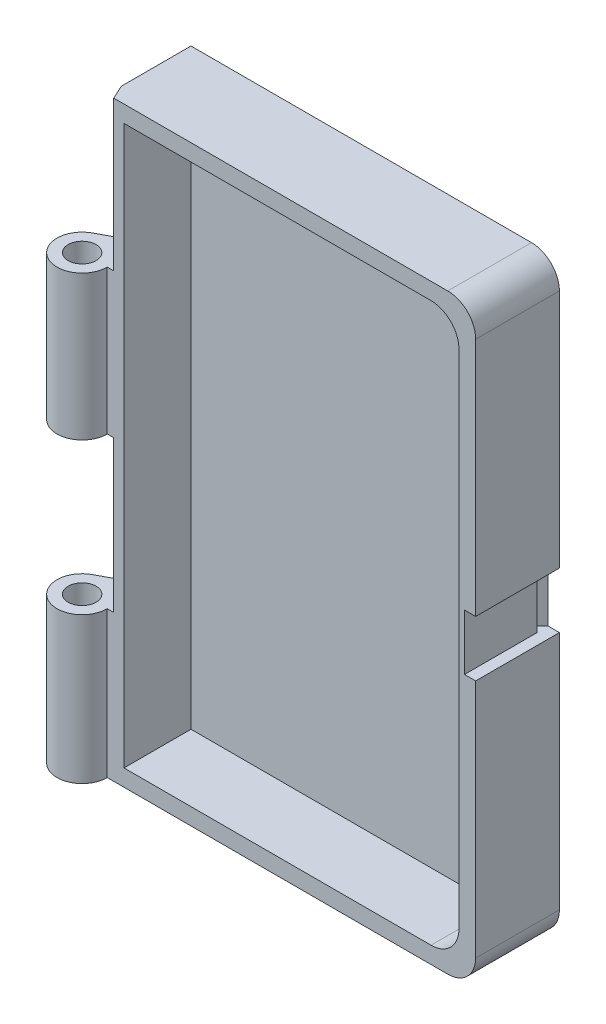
ISO-10303-21;
HEADER;
FILE_DESCRIPTION(('STEP AP214'),'2;1');
FILE_NAME('part.step','',(''),(''),'','','');
FILE_SCHEMA(('AUTOMOTIVE_DESIGN { 1 0 10303 214 1 1 1 1 }'));
ENDSEC;
DATA;
#1=APPLICATION_CONTEXT('core data for automotive mechanical design processes');
#2=APPLICATION_PROTOCOL_DEFINITION('international standard','automotive_design',2000,#1);
#3=PRODUCT_CONTEXT('',#1,'mechanical');
#4=PRODUCT('Part','Part','',(#3));
#5=PRODUCT_RELATED_PRODUCT_CATEGORY('part','',(#4));
#6=PRODUCT_DEFINITION_FORMATION('','',#4);
#7=PRODUCT_DEFINITION_CONTEXT('part definition',#1,'design');
#8=PRODUCT_DEFINITION('design','',#6,#7);
#9=PRODUCT_DEFINITION_SHAPE('','',#8);
#10=(LENGTH_UNIT() NAMED_UNIT(*) SI_UNIT(.MILLI.,.METRE.));
#11=(NAMED_UNIT(*) PLANE_ANGLE_UNIT() SI_UNIT($,.RADIAN.));
#12=(NAMED_UNIT(*) SI_UNIT($,.STERADIAN.) SOLID_ANGLE_UNIT());
#13=UNCERTAINTY_MEASURE_WITH_UNIT(LENGTH_MEASURE(1.E-05),#10,'distance_accuracy_value','');
#14=(GEOMETRIC_REPRESENTATION_CONTEXT(3) GLOBAL_UNCERTAINTY_ASSIGNED_CONTEXT((#13)) GLOBAL_UNIT_ASSIGNED_CONTEXT((#10,
#11,#12)) REPRESENTATION_CONTEXT('',''));
#15=CARTESIAN_POINT('',(0.,0.,0.));
#16=DIRECTION('',(0.,0.,1.));
#17=DIRECTION('',(1.,0.,0.));
#18=AXIS2_PLACEMENT_3D('',#15,#16,#17);
#19=CARTESIAN_POINT('',(33.,-53.,15.));
#20=DIRECTION('',(-1.,0.,0.));
#21=DIRECTION('',(0.,-1.,0.));
#22=AXIS2_PLACEMENT_3D('',#19,#20,#21);
#23=PLANE('',#22);
#24=DIRECTION('',(0.,1.,0.));
#25=VECTOR('',#24,1.);
#26=CARTESIAN_POINT('',(33.,-53.,0.));
#27=LINE('',#26,#25);
#28=CARTESIAN_POINT('',(33.,5.,0.));
#29=VERTEX_POINT('',#28);
#30=CARTESIAN_POINT('',(33.,48.,0.));
#31=VERTEX_POINT('',#30);
#32=EDGE_CURVE('E231',#29,#31,#27,.T.);
#33=ORIENTED_EDGE('',*,*,#32,.T.);
#34=DIRECTION('',(0.,0.,-1.));
#35=VECTOR('',#34,1.);
#36=CARTESIAN_POINT('',(33.,48.,15.));
#37=LINE('',#36,#35);
#38=CARTESIAN_POINT('',(33.,48.,15.));
#39=VERTEX_POINT('',#38);
#40=EDGE_CURVE('E303',#31,#39,#37,.F.);
#41=ORIENTED_EDGE('',*,*,#40,.T.);
#42=DIRECTION('',(0.,1.,0.));
#43=VECTOR('',#42,1.);
#44=CARTESIAN_POINT('',(33.,-53.,15.));
#45=LINE('',#44,#43);
#46=CARTESIAN_POINT('',(33.,5.,15.));
#47=VERTEX_POINT('',#46);
#48=EDGE_CURVE('E234',#47,#39,#45,.T.);
#49=ORIENTED_EDGE('',*,*,#48,.F.);
#50=DIRECTION('',(0.,0.,1.));
#51=VECTOR('',#50,1.);
#52=CARTESIAN_POINT('',(33.,5.,0.));
#53=LINE('',#52,#51);
#54=EDGE_CURVE('E219',#29,#47,#53,.T.);
#55=ORIENTED_EDGE('',*,*,#54,.F.);
#56=EDGE_LOOP('',(#33,#41,#49,#55));
#57=FACE_BOUND('',#56,.T.);
#58=ADVANCED_FACE('F37',(#57),#23,.F.);
#59=CARTESIAN_POINT('',(0.,0.,15.));
#60=DIRECTION('',(0.,0.,1.));
#61=DIRECTION('',(1.,0.,0.));
#62=AXIS2_PLACEMENT_3D('',#59,#60,#61);
#63=PLANE('',#62);
#64=DIRECTION('',(1.,0.,0.));
#65=VECTOR('',#64,1.);
#66=CARTESIAN_POINT('',(-33.,-50.,15.));
#67=LINE('',#66,#65);
#68=CARTESIAN_POINT('',(-30.,-50.,15.));
#69=VERTEX_POINT('',#68);
#70=CARTESIAN_POINT('',(25.,-50.,15.));
#71=VERTEX_POINT('',#70);
#72=EDGE_CURVE('E399',#69,#71,#67,.T.);
#73=ORIENTED_EDGE('',*,*,#72,.F.);
#74=DIRECTION('',(0.,-1.,0.));
#75=VECTOR('',#74,1.);
#76=CARTESIAN_POINT('',(-30.,-53.,15.));
#77=LINE('',#76,#75);
#78=CARTESIAN_POINT('',(-30.,50.,15.));
#79=VERTEX_POINT('',#78);
#80=EDGE_CURVE('E390',#79,#69,#77,.T.);
#81=ORIENTED_EDGE('',*,*,#80,.F.);
#82=DIRECTION('',(-1.,0.,0.));
#83=VECTOR('',#82,1.);
#84=CARTESIAN_POINT('',(-33.,50.,15.));
#85=LINE('',#84,#83);
#86=CARTESIAN_POINT('',(25.,50.,15.));
#87=VERTEX_POINT('',#86);
#88=EDGE_CURVE('E405',#87,#79,#85,.T.);
#89=ORIENTED_EDGE('',*,*,#88,.F.);
#90=CARTESIAN_POINT('',(25.,45.,15.));
#91=DIRECTION('',(0.,0.,1.));
#92=DIRECTION('',(1.,0.,0.));
#93=AXIS2_PLACEMENT_3D('',#90,#91,#92);
#94=CIRCLE('',#93,5.);
#95=CARTESIAN_POINT('',(30.,45.,15.));
#96=VERTEX_POINT('',#95);
#97=EDGE_CURVE('E309',#87,#96,#94,.F.);
#98=ORIENTED_EDGE('',*,*,#97,.T.);
#99=DIRECTION('',(0.,1.,0.));
#100=VECTOR('',#99,1.);
#101=CARTESIAN_POINT('',(30.,-53.,15.));
#102=LINE('',#101,#100);
#103=CARTESIAN_POINT('',(30.,-45.,15.));
#104=VERTEX_POINT('',#103);
#105=EDGE_CURVE('E402',#104,#96,#102,.T.);
#106=ORIENTED_EDGE('',*,*,#105,.F.);
#107=CARTESIAN_POINT('',(25.,-45.,15.));
#108=DIRECTION('',(0.,0.,1.));
#109=DIRECTION('',(1.,0.,0.));
#110=AXIS2_PLACEMENT_3D('',#107,#108,#109);
#111=CIRCLE('',#110,5.);
#112=EDGE_CURVE('E307',#104,#71,#111,.F.);
#113=ORIENTED_EDGE('',*,*,#112,.T.);
#114=EDGE_LOOP('',(#73,#81,#89,#98,#106,#113));
#115=FACE_BOUND('',#114,.T.);
#116=DIRECTION('',(-1.,0.,0.));
#117=VECTOR('',#116,1.);
#118=CARTESIAN_POINT('',(-33.,53.,15.));
#119=LINE('',#118,#117);
#120=CARTESIAN_POINT('',(28.,53.,15.));
#121=VERTEX_POINT('',#120);
#122=CARTESIAN_POINT('',(-31.8342308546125,53.,15.));
#123=VERTEX_POINT('',#122);
#124=EDGE_CURVE('E336',#121,#123,#119,.T.);
#125=ORIENTED_EDGE('',*,*,#124,.T.);
#126=DIRECTION('',(0.,-1.,0.));
#127=VECTOR('',#126,1.);
#128=CARTESIAN_POINT('',(-31.8342308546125,26.2,15.));
#129=LINE('',#128,#127);
#130=CARTESIAN_POINT('',(-31.8342308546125,26.2,15.));
#131=VERTEX_POINT('',#130);
#132=EDGE_CURVE('E328',#123,#131,#129,.T.);
#133=ORIENTED_EDGE('',*,*,#132,.T.);
#134=DIRECTION('',(-1.,0.,0.));
#135=VECTOR('',#134,1.);
#136=CARTESIAN_POINT('',(-33.,26.2,15.));
#137=LINE('',#136,#135);
#138=CARTESIAN_POINT('',(-33.,26.2,15.));
#139=VERTEX_POINT('',#138);
#140=EDGE_CURVE('E326',#131,#139,#137,.T.);
#141=ORIENTED_EDGE('',*,*,#140,.T.);
#142=DIRECTION('',(0.,-1.,0.));
#143=VECTOR('',#142,1.);
#144=CARTESIAN_POINT('',(-33.,-53.,15.));
#145=LINE('',#144,#143);
#146=CARTESIAN_POINT('',(-33.,0.300000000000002,15.));
#147=VERTEX_POINT('',#146);
#148=EDGE_CURVE('E259',#139,#147,#145,.T.);
#149=ORIENTED_EDGE('',*,*,#148,.T.);
#150=DIRECTION('',(1.,0.,0.));
#151=VECTOR('',#150,1.);
#152=CARTESIAN_POINT('',(-33.,0.3,15.));
#153=LINE('',#152,#151);
#154=CARTESIAN_POINT('',(-31.8342308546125,0.3,15.));
#155=VERTEX_POINT('',#154);
#156=EDGE_CURVE('E319',#147,#155,#153,.T.);
#157=ORIENTED_EDGE('',*,*,#156,.T.);
#158=DIRECTION('',(0.,-1.,0.));
#159=VECTOR('',#158,1.);
#160=CARTESIAN_POINT('',(-31.8342308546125,-26.8,15.));
#161=LINE('',#160,#159);
#162=CARTESIAN_POINT('',(-31.8342308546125,-26.8,15.));
#163=VERTEX_POINT('',#162);
#164=EDGE_CURVE('E316',#155,#163,#161,.T.);
#165=ORIENTED_EDGE('',*,*,#164,.T.);
#166=DIRECTION('',(-1.,0.,0.));
#167=VECTOR('',#166,1.);
#168=CARTESIAN_POINT('',(-33.,-26.8,15.));
#169=LINE('',#168,#167);
#170=CARTESIAN_POINT('',(-33.,-26.8,15.));
#171=VERTEX_POINT('',#170);
#172=EDGE_CURVE('E314',#163,#171,#169,.T.);
#173=ORIENTED_EDGE('',*,*,#172,.T.);
#174=CARTESIAN_POINT('',(-33.,-53.,15.));
#175=VERTEX_POINT('',#174);
#176=EDGE_CURVE('E343',#171,#175,#145,.T.);
#177=ORIENTED_EDGE('',*,*,#176,.T.);
#178=DIRECTION('',(1.,0.,0.));
#179=VECTOR('',#178,1.);
#180=CARTESIAN_POINT('',(-33.,-53.,15.));
#181=LINE('',#180,#179);
#182=CARTESIAN_POINT('',(28.,-53.,15.));
#183=VERTEX_POINT('',#182);
#184=EDGE_CURVE('E254',#175,#183,#181,.T.);
#185=ORIENTED_EDGE('',*,*,#184,.T.);
#186=CARTESIAN_POINT('',(28.,-48.,15.));
#187=DIRECTION('',(0.,0.,1.));
#188=DIRECTION('',(1.,0.,0.));
#189=AXIS2_PLACEMENT_3D('',#186,#187,#188);
#190=CIRCLE('',#189,5.);
#191=CARTESIAN_POINT('',(33.,-48.,15.));
#192=VERTEX_POINT('',#191);
#193=EDGE_CURVE('E286',#183,#192,#190,.T.);
#194=ORIENTED_EDGE('',*,*,#193,.T.);
#195=CARTESIAN_POINT('',(33.,-5.,15.));
#196=VERTEX_POINT('',#195);
#197=EDGE_CURVE('E344',#192,#196,#45,.T.);
#198=ORIENTED_EDGE('',*,*,#197,.T.);
#199=DIRECTION('',(-1.,0.,0.));
#200=VECTOR('',#199,1.);
#201=CARTESIAN_POINT('',(33.,-5.,15.));
#202=LINE('',#201,#200);
#203=CARTESIAN_POINT('',(31.,-5.,15.));
#204=VERTEX_POINT('',#203);
#205=EDGE_CURVE('E438',#196,#204,#202,.T.);
#206=ORIENTED_EDGE('',*,*,#205,.T.);
#207=DIRECTION('',(0.,-1.,0.));
#208=VECTOR('',#207,1.);
#209=CARTESIAN_POINT('',(31.,5.,15.));
#210=LINE('',#209,#208);
#211=CARTESIAN_POINT('',(31.,5.,15.));
#212=VERTEX_POINT('',#211);
#213=EDGE_CURVE('E460',#212,#204,#210,.T.);
#214=ORIENTED_EDGE('',*,*,#213,.F.);
#215=DIRECTION('',(-1.,0.,0.));
#216=VECTOR('',#215,1.);
#217=CARTESIAN_POINT('',(33.,5.,15.));
#218=LINE('',#217,#216);
#219=EDGE_CURVE('E235',#47,#212,#218,.T.);
#220=ORIENTED_EDGE('',*,*,#219,.F.);
#221=ORIENTED_EDGE('',*,*,#48,.T.);
#222=CARTESIAN_POINT('',(28.,48.,15.));
#223=DIRECTION('',(0.,0.,1.));
#224=DIRECTION('',(1.,0.,0.));
#225=AXIS2_PLACEMENT_3D('',#222,#223,#224);
#226=CIRCLE('',#225,5.);
#227=EDGE_CURVE('E284',#39,#121,#226,.T.);
#228=ORIENTED_EDGE('',*,*,#227,.T.);
#229=EDGE_LOOP('',(#125,#133,#141,#149,#157,#165,#173,#177,#185,#194,#198,#206,#214,#220,#221,#228));
#230=FACE_BOUND('',#229,.T.);
#231=ADVANCED_FACE('F341',(#115,#230),#63,.T.);
#232=CARTESIAN_POINT('',(0.,0.,0.));
#233=DIRECTION('',(0.,0.,1.));
#234=DIRECTION('',(1.,0.,0.));
#235=AXIS2_PLACEMENT_3D('',#232,#233,#234);
#236=PLANE('',#235);
#237=CARTESIAN_POINT('',(33.,-48.,0.));
#238=VERTEX_POINT('',#237);
#239=CARTESIAN_POINT('',(33.,-5.,0.));
#240=VERTEX_POINT('',#239);
#241=EDGE_CURVE('E241',#238,#240,#27,.T.);
#242=ORIENTED_EDGE('',*,*,#241,.F.);
#243=CARTESIAN_POINT('',(28.,-48.,0.));
#244=DIRECTION('',(0.,0.,1.));
#245=DIRECTION('',(1.,0.,0.));
#246=AXIS2_PLACEMENT_3D('',#243,#244,#245);
#247=CIRCLE('',#246,5.);
#248=CARTESIAN_POINT('',(28.,-53.,0.));
#249=VERTEX_POINT('',#248);
#250=EDGE_CURVE('E280',#238,#249,#247,.F.);
#251=ORIENTED_EDGE('',*,*,#250,.T.);
#252=DIRECTION('',(1.,0.,0.));
#253=VECTOR('',#252,1.);
#254=CARTESIAN_POINT('',(-33.,-53.,0.));
#255=LINE('',#254,#253);
#256=CARTESIAN_POINT('',(-33.,-53.,0.));
#257=VERTEX_POINT('',#256);
#258=EDGE_CURVE('E242',#257,#249,#255,.T.);
#259=ORIENTED_EDGE('',*,*,#258,.F.);
#260=DIRECTION('',(0.,-1.,0.));
#261=VECTOR('',#260,1.);
#262=CARTESIAN_POINT('',(-33.,-53.,0.));
#263=LINE('',#262,#261);
#264=CARTESIAN_POINT('',(-33.,53.,0.));
#265=VERTEX_POINT('',#264);
#266=EDGE_CURVE('E252',#265,#257,#263,.T.);
#267=ORIENTED_EDGE('',*,*,#266,.F.);
#268=DIRECTION('',(-1.,0.,0.));
#269=VECTOR('',#268,1.);
#270=CARTESIAN_POINT('',(-33.,53.,0.));
#271=LINE('',#270,#269);
#272=CARTESIAN_POINT('',(28.,53.,0.));
#273=VERTEX_POINT('',#272);
#274=EDGE_CURVE('E244',#273,#265,#271,.T.);
#275=ORIENTED_EDGE('',*,*,#274,.F.);
#276=CARTESIAN_POINT('',(28.,48.,0.));
#277=DIRECTION('',(0.,0.,1.));
#278=DIRECTION('',(1.,0.,0.));
#279=AXIS2_PLACEMENT_3D('',#276,#277,#278);
#280=CIRCLE('',#279,5.);
#281=EDGE_CURVE('E240',#273,#31,#280,.F.);
#282=ORIENTED_EDGE('',*,*,#281,.T.);
#283=ORIENTED_EDGE('',*,*,#32,.F.);
#284=DIRECTION('',(1.,0.,0.));
#285=VECTOR('',#284,1.);
#286=CARTESIAN_POINT('',(31.,5.,0.));
#287=LINE('',#286,#285);
#288=CARTESIAN_POINT('',(31.,5.,0.));
#289=VERTEX_POINT('',#288);
#290=EDGE_CURVE('E215',#289,#29,#287,.T.);
#291=ORIENTED_EDGE('',*,*,#290,.F.);
#292=DIRECTION('',(0.,-1.,0.));
#293=VECTOR('',#292,1.);
#294=CARTESIAN_POINT('',(31.,5.,0.));
#295=LINE('',#294,#293);
#296=CARTESIAN_POINT('',(31.,-5.,0.));
#297=VERTEX_POINT('',#296);
#298=EDGE_CURVE('E452',#289,#297,#295,.T.);
#299=ORIENTED_EDGE('',*,*,#298,.T.);
#300=DIRECTION('',(1.,0.,0.));
#301=VECTOR('',#300,1.);
#302=CARTESIAN_POINT('',(31.,-5.,0.));
#303=LINE('',#302,#301);
#304=EDGE_CURVE('E439',#297,#240,#303,.T.);
#305=ORIENTED_EDGE('',*,*,#304,.T.);
#306=EDGE_LOOP('',(#242,#251,#259,#267,#275,#282,#283,#291,#299,#305));
#307=FACE_BOUND('',#306,.T.);
#308=ADVANCED_FACE('F238',(#307),#236,.F.);
#309=CARTESIAN_POINT('',(-37.5,53.,15.));
#310=DIRECTION('',(0.,-1.,0.));
#311=DIRECTION('',(0.,0.,-1.));
#312=AXIS2_PLACEMENT_3D('',#309,#310,#311);
#313=CYLINDRICAL_SURFACE('',#312,4.5);
#314=CARTESIAN_POINT('',(-37.5,-26.8,15.));
#315=DIRECTION('',(0.,-1.,0.));
#316=DIRECTION('',(1.,0.,0.));
#317=AXIS2_PLACEMENT_3D('',#314,#315,#316);
#318=CIRCLE('',#317,4.5);
#319=CARTESIAN_POINT('',(-39.6176470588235,-26.8,11.0294117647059));
#320=VERTEX_POINT('',#319);
#321=EDGE_CURVE('E271',#320,#171,#318,.F.);
#322=ORIENTED_EDGE('',*,*,#321,.F.);
#323=DIRECTION('',(0.,-1.,0.));
#324=VECTOR('',#323,1.);
#325=CARTESIAN_POINT('',(-39.6176470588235,53.,11.0294117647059));
#326=LINE('',#325,#324);
#327=CARTESIAN_POINT('',(-39.6176470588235,-53.,11.0294117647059));
#328=VERTEX_POINT('',#327);
#329=EDGE_CURVE('E378',#320,#328,#326,.T.);
#330=ORIENTED_EDGE('',*,*,#329,.T.);
#331=CARTESIAN_POINT('',(-37.5,-53.,15.));
#332=DIRECTION('',(0.,-1.,0.));
#333=DIRECTION('',(0.,0.,1.));
#334=AXIS2_PLACEMENT_3D('',#331,#332,#333);
#335=CIRCLE('',#334,4.5);
#336=EDGE_CURVE('E372',#175,#328,#335,.T.);
#337=ORIENTED_EDGE('',*,*,#336,.F.);
#338=ORIENTED_EDGE('',*,*,#176,.F.);
#339=EDGE_LOOP('',(#322,#330,#337,#338));
#340=FACE_BOUND('',#339,.T.);
#341=ADVANCED_FACE('F416',(#340),#313,.T.);
#342=CARTESIAN_POINT('',(-39.6176470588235,53.,11.0294117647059));
#343=DIRECTION('',(-0.470588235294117,0.,-0.882352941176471));
#344=DIRECTION('',(-0.882352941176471,0.,0.470588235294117));
#345=AXIS2_PLACEMENT_3D('',#342,#343,#344);
#346=PLANE('',#345);
#347=DIRECTION('',(-0.882352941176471,0.,0.470588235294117));
#348=VECTOR('',#347,1.);
#349=CARTESIAN_POINT('',(-39.6176470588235,26.2,11.0294117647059));
#350=LINE('',#349,#348);
#351=CARTESIAN_POINT('',(-33.,26.2,7.5));
#352=VERTEX_POINT('',#351);
#353=CARTESIAN_POINT('',(-39.6176470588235,26.2,11.0294117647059));
#354=VERTEX_POINT('',#353);
#355=EDGE_CURVE('E275',#352,#354,#350,.T.);
#356=ORIENTED_EDGE('',*,*,#355,.F.);
#357=DIRECTION('',(0.,-1.,0.));
#358=VECTOR('',#357,1.);
#359=CARTESIAN_POINT('',(-33.,53.,7.5));
#360=LINE('',#359,#358);
#361=CARTESIAN_POINT('',(-33.,0.300000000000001,7.5));
#362=VERTEX_POINT('',#361);
#363=EDGE_CURVE('E381',#352,#362,#360,.T.);
#364=ORIENTED_EDGE('',*,*,#363,.T.);
#365=DIRECTION('',(0.882352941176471,0.,-0.470588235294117));
#366=VECTOR('',#365,1.);
#367=CARTESIAN_POINT('',(-39.6176470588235,0.300000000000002,11.0294117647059));
#368=LINE('',#367,#366);
#369=CARTESIAN_POINT('',(-39.6176470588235,0.300000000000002,11.0294117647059));
#370=VERTEX_POINT('',#369);
#371=EDGE_CURVE('E270',#370,#362,#368,.T.);
#372=ORIENTED_EDGE('',*,*,#371,.F.);
#373=EDGE_CURVE('E359',#354,#370,#326,.T.);
#374=ORIENTED_EDGE('',*,*,#373,.F.);
#375=EDGE_LOOP('',(#356,#364,#372,#374));
#376=FACE_BOUND('',#375,.T.);
#377=ADVANCED_FACE('F525',(#376),#346,.T.);
#378=CARTESIAN_POINT('',(-33.,-53.,15.));
#379=DIRECTION('',(0.,1.,0.));
#380=DIRECTION('',(0.,0.,1.));
#381=AXIS2_PLACEMENT_3D('',#378,#379,#380);
#382=PLANE('',#381);
#383=ORIENTED_EDGE('',*,*,#258,.T.);
#384=DIRECTION('',(0.,0.,-1.));
#385=VECTOR('',#384,1.);
#386=CARTESIAN_POINT('',(28.,-53.,15.));
#387=LINE('',#386,#385);
#388=EDGE_CURVE('E282',#249,#183,#387,.F.);
#389=ORIENTED_EDGE('',*,*,#388,.T.);
#390=ORIENTED_EDGE('',*,*,#184,.F.);
#391=ORIENTED_EDGE('',*,*,#336,.T.);
#392=DIRECTION('',(0.882352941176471,0.,-0.470588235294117));
#393=VECTOR('',#392,1.);
#394=CARTESIAN_POINT('',(-39.6176470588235,-53.,11.0294117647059));
#395=LINE('',#394,#393);
#396=CARTESIAN_POINT('',(-33.,-53.,7.5));
#397=VERTEX_POINT('',#396);
#398=EDGE_CURVE('E375',#328,#397,#395,.T.);
#399=ORIENTED_EDGE('',*,*,#398,.T.);
#400=DIRECTION('',(0.,0.,-1.));
#401=VECTOR('',#400,1.);
#402=CARTESIAN_POINT('',(-33.,-53.,15.));
#403=LINE('',#402,#401);
#404=EDGE_CURVE('E255',#397,#257,#403,.T.);
#405=ORIENTED_EDGE('',*,*,#404,.T.);
#406=EDGE_LOOP('',(#383,#389,#390,#391,#399,#405));
#407=FACE_BOUND('',#406,.T.);
#408=CARTESIAN_POINT('',(-37.5,-53.,15.));
#409=DIRECTION('',(0.,-1.,0.));
#410=DIRECTION('',(0.,0.,-1.));
#411=AXIS2_PLACEMENT_3D('',#408,#409,#410);
#412=CIRCLE('',#411,2.5);
#413=CARTESIAN_POINT('',(-37.5,-53.,12.5));
#414=VERTEX_POINT('',#413);
#415=EDGE_CURVE('E369',#414,#414,#412,.T.);
#416=ORIENTED_EDGE('',*,*,#415,.F.);
#417=EDGE_LOOP('',(#416));
#418=FACE_BOUND('',#417,.T.);
#419=ADVANCED_FACE('F420',(#407,#418),#382,.F.);
#420=ORIENTED_EDGE('',*,*,#197,.F.);
#421=DIRECTION('',(0.,0.,-1.));
#422=VECTOR('',#421,1.);
#423=CARTESIAN_POINT('',(33.,-48.,15.));
#424=LINE('',#423,#422);
#425=EDGE_CURVE('E261',#192,#238,#424,.T.);
#426=ORIENTED_EDGE('',*,*,#425,.T.);
#427=ORIENTED_EDGE('',*,*,#241,.T.);
#428=DIRECTION('',(0.,0.,1.));
#429=VECTOR('',#428,1.);
#430=CARTESIAN_POINT('',(33.,-5.,0.));
#431=LINE('',#430,#429);
#432=EDGE_CURVE('E434',#240,#196,#431,.T.);
#433=ORIENTED_EDGE('',*,*,#432,.T.);
#434=EDGE_LOOP('',(#420,#426,#427,#433));
#435=FACE_BOUND('',#434,.T.);
#436=ADVANCED_FACE('F432',(#435),#23,.F.);
#437=CARTESIAN_POINT('',(-33.,53.,15.));
#438=DIRECTION('',(0.,-1.,0.));
#439=DIRECTION('',(0.,0.,-1.));
#440=AXIS2_PLACEMENT_3D('',#437,#438,#439);
#441=PLANE('',#440);
#442=DIRECTION('',(0.,0.,-1.));
#443=VECTOR('',#442,1.);
#444=CARTESIAN_POINT('',(-33.,53.,15.));
#445=LINE('',#444,#443);
#446=CARTESIAN_POINT('',(-33.,53.,12.5));
#447=VERTEX_POINT('',#446);
#448=EDGE_CURVE('E258',#447,#265,#445,.T.);
#449=ORIENTED_EDGE('',*,*,#448,.F.);
#450=DIRECTION('',(0.422618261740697,0.,0.906307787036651));
#451=VECTOR('',#450,1.);
#452=CARTESIAN_POINT('',(-31.8342308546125,53.,15.));
#453=LINE('',#452,#451);
#454=EDGE_CURVE('E46',#447,#123,#453,.T.);
#455=ORIENTED_EDGE('',*,*,#454,.T.);
#456=ORIENTED_EDGE('',*,*,#124,.F.);
#457=DIRECTION('',(0.,0.,-1.));
#458=VECTOR('',#457,1.);
#459=CARTESIAN_POINT('',(28.,53.,15.));
#460=LINE('',#459,#458);
#461=EDGE_CURVE('E300',#121,#273,#460,.T.);
#462=ORIENTED_EDGE('',*,*,#461,.T.);
#463=ORIENTED_EDGE('',*,*,#274,.T.);
#464=EDGE_LOOP('',(#449,#455,#456,#462,#463));
#465=FACE_BOUND('',#464,.T.);
#466=ADVANCED_FACE('F335',(#465),#441,.F.);
#467=CARTESIAN_POINT('',(-33.,-53.,15.));
#468=DIRECTION('',(1.,0.,0.));
#469=DIRECTION('',(0.,0.,-1.));
#470=AXIS2_PLACEMENT_3D('',#467,#468,#469);
#471=PLANE('',#470);
#472=DIRECTION('',(0.,0.,-1.));
#473=VECTOR('',#472,1.);
#474=CARTESIAN_POINT('',(-33.,26.2,19.5));
#475=LINE('',#474,#473);
#476=CARTESIAN_POINT('',(-33.,26.2,12.5));
#477=VERTEX_POINT('',#476);
#478=EDGE_CURVE('E266',#477,#352,#475,.T.);
#479=ORIENTED_EDGE('',*,*,#478,.F.);
#480=DIRECTION('',(0.,1.,0.));
#481=VECTOR('',#480,1.);
#482=CARTESIAN_POINT('',(-33.,53.,12.5));
#483=LINE('',#482,#481);
#484=EDGE_CURVE('E53',#477,#447,#483,.T.);
#485=ORIENTED_EDGE('',*,*,#484,.T.);
#486=ORIENTED_EDGE('',*,*,#448,.T.);
#487=ORIENTED_EDGE('',*,*,#266,.T.);
#488=ORIENTED_EDGE('',*,*,#404,.F.);
#489=CARTESIAN_POINT('',(-33.,-26.8,7.5));
#490=VERTEX_POINT('',#489);
#491=EDGE_CURVE('E379',#490,#397,#360,.T.);
#492=ORIENTED_EDGE('',*,*,#491,.F.);
#493=DIRECTION('',(0.,0.,-1.));
#494=VECTOR('',#493,1.);
#495=CARTESIAN_POINT('',(-33.,-26.8,19.5));
#496=LINE('',#495,#494);
#497=CARTESIAN_POINT('',(-33.,-26.8,12.5));
#498=VERTEX_POINT('',#497);
#499=EDGE_CURVE('E454',#498,#490,#496,.T.);
#500=ORIENTED_EDGE('',*,*,#499,.F.);
#501=DIRECTION('',(0.,1.,0.));
#502=VECTOR('',#501,1.);
#503=CARTESIAN_POINT('',(-33.,0.300000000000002,12.5));
#504=LINE('',#503,#502);
#505=CARTESIAN_POINT('',(-33.,0.3,12.5));
#506=VERTEX_POINT('',#505);
#507=EDGE_CURVE('E311',#498,#506,#504,.T.);
#508=ORIENTED_EDGE('',*,*,#507,.T.);
#509=DIRECTION('',(0.,0.,-1.));
#510=VECTOR('',#509,1.);
#511=CARTESIAN_POINT('',(-33.,0.3,19.5));
#512=LINE('',#511,#510);
#513=EDGE_CURVE('E463',#506,#362,#512,.T.);
#514=ORIENTED_EDGE('',*,*,#513,.T.);
#515=ORIENTED_EDGE('',*,*,#363,.F.);
#516=EDGE_LOOP('',(#479,#485,#486,#487,#488,#492,#500,#508,#514,#515));
#517=FACE_BOUND('',#516,.T.);
#518=ADVANCED_FACE('F476',(#517),#471,.F.);
#519=CARTESIAN_POINT('',(-33.,-50.,15.));
#520=DIRECTION('',(0.,1.,0.));
#521=DIRECTION('',(0.,0.,1.));
#522=AXIS2_PLACEMENT_3D('',#519,#520,#521);
#523=PLANE('',#522);
#524=ORIENTED_EDGE('',*,*,#72,.T.);
#525=DIRECTION('',(0.,0.,-1.));
#526=VECTOR('',#525,1.);
#527=CARTESIAN_POINT('',(25.,-50.,3.));
#528=LINE('',#527,#526);
#529=CARTESIAN_POINT('',(25.,-50.,3.));
#530=VERTEX_POINT('',#529);
#531=EDGE_CURVE('E288',#71,#530,#528,.T.);
#532=ORIENTED_EDGE('',*,*,#531,.T.);
#533=DIRECTION('',(1.,0.,0.));
#534=VECTOR('',#533,1.);
#535=CARTESIAN_POINT('',(-33.,-50.,3.));
#536=LINE('',#535,#534);
#537=CARTESIAN_POINT('',(-30.,-50.,3.));
#538=VERTEX_POINT('',#537);
#539=EDGE_CURVE('E383',#538,#530,#536,.T.);
#540=ORIENTED_EDGE('',*,*,#539,.F.);
#541=DIRECTION('',(0.,0.,-1.));
#542=VECTOR('',#541,1.);
#543=CARTESIAN_POINT('',(-30.,-50.,15.));
#544=LINE('',#543,#542);
#545=EDGE_CURVE('E387',#69,#538,#544,.T.);
#546=ORIENTED_EDGE('',*,*,#545,.F.);
#547=EDGE_LOOP('',(#524,#532,#540,#546));
#548=FACE_BOUND('',#547,.T.);
#549=ADVANCED_FACE('F564',(#548),#523,.T.);
#550=CARTESIAN_POINT('',(30.,-53.,15.));
#551=DIRECTION('',(-1.,0.,0.));
#552=DIRECTION('',(0.,-1.,0.));
#553=AXIS2_PLACEMENT_3D('',#550,#551,#552);
#554=PLANE('',#553);
#555=DIRECTION('',(0.,1.,0.));
#556=VECTOR('',#555,1.);
#557=CARTESIAN_POINT('',(30.,-53.,3.));
#558=LINE('',#557,#556);
#559=CARTESIAN_POINT('',(30.,-45.,3.));
#560=VERTEX_POINT('',#559);
#561=CARTESIAN_POINT('',(30.,45.,3.));
#562=VERTEX_POINT('',#561);
#563=EDGE_CURVE('E386',#560,#562,#558,.T.);
#564=ORIENTED_EDGE('',*,*,#563,.F.);
#565=DIRECTION('',(0.,0.,-1.));
#566=VECTOR('',#565,1.);
#567=CARTESIAN_POINT('',(30.,-45.,15.));
#568=LINE('',#567,#566);
#569=EDGE_CURVE('E298',#560,#104,#568,.F.);
#570=ORIENTED_EDGE('',*,*,#569,.T.);
#571=ORIENTED_EDGE('',*,*,#105,.T.);
#572=DIRECTION('',(0.,0.,-1.));
#573=VECTOR('',#572,1.);
#574=CARTESIAN_POINT('',(30.,45.,3.));
#575=LINE('',#574,#573);
#576=EDGE_CURVE('E295',#96,#562,#575,.T.);
#577=ORIENTED_EDGE('',*,*,#576,.T.);
#578=EDGE_LOOP('',(#564,#570,#571,#577));
#579=FACE_BOUND('',#578,.T.);
#580=ADVANCED_FACE('F567',(#579),#554,.T.);
#581=CARTESIAN_POINT('',(-33.,50.,15.));
#582=DIRECTION('',(0.,-1.,0.));
#583=DIRECTION('',(0.,0.,-1.));
#584=AXIS2_PLACEMENT_3D('',#581,#582,#583);
#585=PLANE('',#584);
#586=DIRECTION('',(-1.,0.,0.));
#587=VECTOR('',#586,1.);
#588=CARTESIAN_POINT('',(-33.,50.,3.));
#589=LINE('',#588,#587);
#590=CARTESIAN_POINT('',(25.,50.,3.));
#591=VERTEX_POINT('',#590);
#592=CARTESIAN_POINT('',(-30.,50.,3.));
#593=VERTEX_POINT('',#592);
#594=EDGE_CURVE('E393',#591,#593,#589,.T.);
#595=ORIENTED_EDGE('',*,*,#594,.F.);
#596=DIRECTION('',(0.,0.,-1.));
#597=VECTOR('',#596,1.);
#598=CARTESIAN_POINT('',(25.,50.,15.));
#599=LINE('',#598,#597);
#600=EDGE_CURVE('E305',#591,#87,#599,.F.);
#601=ORIENTED_EDGE('',*,*,#600,.T.);
#602=ORIENTED_EDGE('',*,*,#88,.T.);
#603=DIRECTION('',(0.,0.,-1.));
#604=VECTOR('',#603,1.);
#605=CARTESIAN_POINT('',(-30.,50.,15.));
#606=LINE('',#605,#604);
#607=EDGE_CURVE('E246',#79,#593,#606,.T.);
#608=ORIENTED_EDGE('',*,*,#607,.T.);
#609=EDGE_LOOP('',(#595,#601,#602,#608));
#610=FACE_BOUND('',#609,.T.);
#611=ADVANCED_FACE('F571',(#610),#585,.T.);
#612=CARTESIAN_POINT('',(-30.,-53.,15.));
#613=DIRECTION('',(1.,0.,0.));
#614=DIRECTION('',(0.,0.,-1.));
#615=AXIS2_PLACEMENT_3D('',#612,#613,#614);
#616=PLANE('',#615);
#617=DIRECTION('',(0.,-1.,0.));
#618=VECTOR('',#617,1.);
#619=CARTESIAN_POINT('',(-30.,-53.,3.));
#620=LINE('',#619,#618);
#621=EDGE_CURVE('E395',#593,#538,#620,.T.);
#622=ORIENTED_EDGE('',*,*,#621,.F.);
#623=ORIENTED_EDGE('',*,*,#607,.F.);
#624=ORIENTED_EDGE('',*,*,#80,.T.);
#625=ORIENTED_EDGE('',*,*,#545,.T.);
#626=EDGE_LOOP('',(#622,#623,#624,#625));
#627=FACE_BOUND('',#626,.T.);
#628=ADVANCED_FACE('F575',(#627),#616,.T.);
#629=CARTESIAN_POINT('',(0.,0.,3.));
#630=DIRECTION('',(0.,0.,1.));
#631=DIRECTION('',(1.,0.,0.));
#632=AXIS2_PLACEMENT_3D('',#629,#630,#631);
#633=PLANE('',#632);
#634=ORIENTED_EDGE('',*,*,#539,.T.);
#635=CARTESIAN_POINT('',(25.,-45.,3.));
#636=DIRECTION('',(0.,0.,1.));
#637=DIRECTION('',(1.,0.,0.));
#638=AXIS2_PLACEMENT_3D('',#635,#636,#637);
#639=CIRCLE('',#638,5.);
#640=EDGE_CURVE('E293',#530,#560,#639,.T.);
#641=ORIENTED_EDGE('',*,*,#640,.T.);
#642=ORIENTED_EDGE('',*,*,#563,.T.);
#643=CARTESIAN_POINT('',(25.,45.,3.));
#644=DIRECTION('',(0.,0.,1.));
#645=DIRECTION('',(1.,0.,0.));
#646=AXIS2_PLACEMENT_3D('',#643,#644,#645);
#647=CIRCLE('',#646,5.);
#648=EDGE_CURVE('E291',#562,#591,#647,.T.);
#649=ORIENTED_EDGE('',*,*,#648,.T.);
#650=ORIENTED_EDGE('',*,*,#594,.T.);
#651=ORIENTED_EDGE('',*,*,#621,.T.);
#652=EDGE_LOOP('',(#634,#641,#642,#649,#650,#651));
#653=FACE_BOUND('',#652,.T.);
#654=ADVANCED_FACE('F563',(#653),#633,.T.);
#655=CARTESIAN_POINT('',(-37.5,26.2,15.));
#656=DIRECTION('',(0.,-1.,0.));
#657=DIRECTION('',(0.,0.,-1.));
#658=AXIS2_PLACEMENT_3D('',#655,#656,#657);
#659=CIRCLE('',#658,4.5);
#660=EDGE_CURVE('E350',#354,#139,#659,.F.);
#661=ORIENTED_EDGE('',*,*,#660,.F.);
#662=ORIENTED_EDGE('',*,*,#373,.T.);
#663=CARTESIAN_POINT('',(-37.5,0.300000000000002,15.));
#664=DIRECTION('',(0.,1.,0.));
#665=DIRECTION('',(-1.,0.,0.));
#666=AXIS2_PLACEMENT_3D('',#663,#664,#665);
#667=CIRCLE('',#666,4.5);
#668=EDGE_CURVE('E276',#147,#370,#667,.F.);
#669=ORIENTED_EDGE('',*,*,#668,.F.);
#670=ORIENTED_EDGE('',*,*,#148,.F.);
#671=EDGE_LOOP('',(#661,#662,#669,#670));
#672=FACE_BOUND('',#671,.T.);
#673=ADVANCED_FACE('F357',(#672),#313,.T.);
#674=DIRECTION('',(-0.882352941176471,0.,0.470588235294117));
#675=VECTOR('',#674,1.);
#676=CARTESIAN_POINT('',(-39.6176470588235,-26.8,11.0294117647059));
#677=LINE('',#676,#675);
#678=EDGE_CURVE('E265',#490,#320,#677,.T.);
#679=ORIENTED_EDGE('',*,*,#678,.F.);
#680=ORIENTED_EDGE('',*,*,#491,.T.);
#681=ORIENTED_EDGE('',*,*,#398,.F.);
#682=ORIENTED_EDGE('',*,*,#329,.F.);
#683=EDGE_LOOP('',(#679,#680,#681,#682));
#684=FACE_BOUND('',#683,.T.);
#685=ADVANCED_FACE('F474',(#684),#346,.T.);
#686=CARTESIAN_POINT('',(-37.5,53.,15.));
#687=DIRECTION('',(0.,-1.,0.));
#688=DIRECTION('',(0.,0.,-1.));
#689=AXIS2_PLACEMENT_3D('',#686,#687,#688);
#690=CYLINDRICAL_SURFACE('',#689,2.5);
#691=CARTESIAN_POINT('',(-37.5,-26.8,15.));
#692=DIRECTION('',(0.,-1.,0.));
#693=DIRECTION('',(1.,0.,0.));
#694=AXIS2_PLACEMENT_3D('',#691,#692,#693);
#695=CIRCLE('',#694,2.5);
#696=CARTESIAN_POINT('',(-35.,-26.8,15.));
#697=VERTEX_POINT('',#696);
#698=EDGE_CURVE('E262',#697,#697,#695,.F.);
#699=ORIENTED_EDGE('',*,*,#698,.T.);
#700=EDGE_LOOP('',(#699));
#701=FACE_BOUND('',#700,.T.);
#702=ORIENTED_EDGE('',*,*,#415,.T.);
#703=EDGE_LOOP('',(#702));
#704=FACE_BOUND('',#703,.T.);
#705=ADVANCED_FACE('F554',(#701,#704),#690,.F.);
#706=CARTESIAN_POINT('',(-33.,0.3,19.5));
#707=DIRECTION('',(0.,1.,0.));
#708=DIRECTION('',(-1.,0.,0.));
#709=AXIS2_PLACEMENT_3D('',#706,#707,#708);
#710=PLANE('',#709);
#711=ORIENTED_EDGE('',*,*,#668,.T.);
#712=ORIENTED_EDGE('',*,*,#371,.T.);
#713=ORIENTED_EDGE('',*,*,#513,.F.);
#714=DIRECTION('',(0.422618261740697,0.,0.906307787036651));
#715=VECTOR('',#714,1.);
#716=CARTESIAN_POINT('',(-30.3188444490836,0.3,18.2497566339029));
#717=LINE('',#716,#715);
#718=EDGE_CURVE('E322',#506,#155,#717,.T.);
#719=ORIENTED_EDGE('',*,*,#718,.T.);
#720=ORIENTED_EDGE('',*,*,#156,.F.);
#721=EDGE_LOOP('',(#711,#712,#713,#719,#720));
#722=FACE_BOUND('',#721,.T.);
#723=CARTESIAN_POINT('',(-37.5,0.300000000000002,15.));
#724=DIRECTION('',(0.,1.,0.));
#725=DIRECTION('',(-1.,0.,0.));
#726=AXIS2_PLACEMENT_3D('',#723,#724,#725);
#727=CIRCLE('',#726,2.5);
#728=CARTESIAN_POINT('',(-40.,0.300000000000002,15.));
#729=VERTEX_POINT('',#728);
#730=EDGE_CURVE('E267',#729,#729,#727,.F.);
#731=ORIENTED_EDGE('',*,*,#730,.F.);
#732=EDGE_LOOP('',(#731));
#733=FACE_BOUND('',#732,.T.);
#734=ADVANCED_FACE('F551',(#722,#733),#710,.F.);
#735=CARTESIAN_POINT('',(-33.,-26.8,19.5));
#736=DIRECTION('',(0.,-1.,0.));
#737=DIRECTION('',(1.,0.,0.));
#738=AXIS2_PLACEMENT_3D('',#735,#736,#737);
#739=PLANE('',#738);
#740=ORIENTED_EDGE('',*,*,#321,.T.);
#741=ORIENTED_EDGE('',*,*,#172,.F.);
#742=DIRECTION('',(-0.422618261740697,0.,-0.906307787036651));
#743=VECTOR('',#742,1.);
#744=CARTESIAN_POINT('',(-30.3188444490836,-26.8,18.2497566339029));
#745=LINE('',#744,#743);
#746=EDGE_CURVE('E324',#163,#498,#745,.T.);
#747=ORIENTED_EDGE('',*,*,#746,.T.);
#748=ORIENTED_EDGE('',*,*,#499,.T.);
#749=ORIENTED_EDGE('',*,*,#678,.T.);
#750=EDGE_LOOP('',(#740,#741,#747,#748,#749));
#751=FACE_BOUND('',#750,.T.);
#752=ORIENTED_EDGE('',*,*,#698,.F.);
#753=EDGE_LOOP('',(#752));
#754=FACE_BOUND('',#753,.T.);
#755=ADVANCED_FACE('F468',(#751,#754),#739,.F.);
#756=CARTESIAN_POINT('',(-37.5,26.2,15.));
#757=DIRECTION('',(0.,-1.,0.));
#758=DIRECTION('',(0.,0.,-1.));
#759=AXIS2_PLACEMENT_3D('',#756,#757,#758);
#760=CIRCLE('',#759,2.5);
#761=CARTESIAN_POINT('',(-37.5,26.2,12.5));
#762=VERTEX_POINT('',#761);
#763=EDGE_CURVE('E272',#762,#762,#760,.F.);
#764=ORIENTED_EDGE('',*,*,#763,.T.);
#765=EDGE_LOOP('',(#764));
#766=FACE_BOUND('',#765,.T.);
#767=ORIENTED_EDGE('',*,*,#730,.T.);
#768=EDGE_LOOP('',(#767));
#769=FACE_BOUND('',#768,.T.);
#770=ADVANCED_FACE('F550',(#766,#769),#690,.F.);
#771=CARTESIAN_POINT('',(-33.,26.2,19.5));
#772=DIRECTION('',(0.,-1.,0.));
#773=DIRECTION('',(0.,0.,-1.));
#774=AXIS2_PLACEMENT_3D('',#771,#772,#773);
#775=PLANE('',#774);
#776=ORIENTED_EDGE('',*,*,#660,.T.);
#777=ORIENTED_EDGE('',*,*,#140,.F.);
#778=DIRECTION('',(-0.422618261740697,0.,-0.906307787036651));
#779=VECTOR('',#778,1.);
#780=CARTESIAN_POINT('',(-30.3188444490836,26.2,18.2497566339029));
#781=LINE('',#780,#779);
#782=EDGE_CURVE('E11',#131,#477,#781,.T.);
#783=ORIENTED_EDGE('',*,*,#782,.T.);
#784=ORIENTED_EDGE('',*,*,#478,.T.);
#785=ORIENTED_EDGE('',*,*,#355,.T.);
#786=EDGE_LOOP('',(#776,#777,#783,#784,#785));
#787=FACE_BOUND('',#786,.T.);
#788=ORIENTED_EDGE('',*,*,#763,.F.);
#789=EDGE_LOOP('',(#788));
#790=FACE_BOUND('',#789,.T.);
#791=ADVANCED_FACE('F347',(#787,#790),#775,.F.);
#792=CARTESIAN_POINT('',(31.,5.,0.));
#793=DIRECTION('',(0.707106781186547,0.,0.707106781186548));
#794=DIRECTION('',(0.707106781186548,0.,-0.707106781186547));
#795=AXIS2_PLACEMENT_3D('',#792,#793,#794);
#796=PLANE('',#795);
#797=DIRECTION('',(-0.707106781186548,0.,0.707106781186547));
#798=VECTOR('',#797,1.);
#799=CARTESIAN_POINT('',(31.,-5.,0.));
#800=LINE('',#799,#798);
#801=CARTESIAN_POINT('',(29.,-5.,2.));
#802=VERTEX_POINT('',#801);
#803=EDGE_CURVE('E226',#297,#802,#800,.T.);
#804=ORIENTED_EDGE('',*,*,#803,.F.);
#805=ORIENTED_EDGE('',*,*,#298,.F.);
#806=DIRECTION('',(-0.707106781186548,0.,0.707106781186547));
#807=VECTOR('',#806,1.);
#808=CARTESIAN_POINT('',(31.,5.,0.));
#809=LINE('',#808,#807);
#810=CARTESIAN_POINT('',(29.,5.,2.));
#811=VERTEX_POINT('',#810);
#812=EDGE_CURVE('E222',#289,#811,#809,.T.);
#813=ORIENTED_EDGE('',*,*,#812,.T.);
#814=DIRECTION('',(0.,-1.,0.));
#815=VECTOR('',#814,1.);
#816=CARTESIAN_POINT('',(29.,5.,2.));
#817=LINE('',#816,#815);
#818=EDGE_CURVE('E455',#811,#802,#817,.T.);
#819=ORIENTED_EDGE('',*,*,#818,.T.);
#820=EDGE_LOOP('',(#804,#805,#813,#819));
#821=FACE_BOUND('',#820,.T.);
#822=ADVANCED_FACE('F483',(#821),#796,.T.);
#823=CARTESIAN_POINT('',(29.,5.,2.));
#824=DIRECTION('',(0.,0.,-1.));
#825=DIRECTION('',(-1.,0.,0.));
#826=AXIS2_PLACEMENT_3D('',#823,#824,#825);
#827=PLANE('',#826);
#828=DIRECTION('',(1.,0.,0.));
#829=VECTOR('',#828,1.);
#830=CARTESIAN_POINT('',(29.,-5.,2.));
#831=LINE('',#830,#829);
#832=CARTESIAN_POINT('',(31.,-5.,2.));
#833=VERTEX_POINT('',#832);
#834=EDGE_CURVE('E448',#802,#833,#831,.T.);
#835=ORIENTED_EDGE('',*,*,#834,.F.);
#836=ORIENTED_EDGE('',*,*,#818,.F.);
#837=DIRECTION('',(1.,0.,0.));
#838=VECTOR('',#837,1.);
#839=CARTESIAN_POINT('',(29.,5.,2.));
#840=LINE('',#839,#838);
#841=CARTESIAN_POINT('',(31.,5.,2.));
#842=VERTEX_POINT('',#841);
#843=EDGE_CURVE('E487',#811,#842,#840,.T.);
#844=ORIENTED_EDGE('',*,*,#843,.T.);
#845=DIRECTION('',(0.,-1.,0.));
#846=VECTOR('',#845,1.);
#847=CARTESIAN_POINT('',(31.,5.,2.));
#848=LINE('',#847,#846);
#849=EDGE_CURVE('E458',#842,#833,#848,.T.);
#850=ORIENTED_EDGE('',*,*,#849,.T.);
#851=EDGE_LOOP('',(#835,#836,#844,#850));
#852=FACE_BOUND('',#851,.T.);
#853=ADVANCED_FACE('F485',(#852),#827,.T.);
#854=CARTESIAN_POINT('',(31.,5.,15.));
#855=DIRECTION('',(-1.,0.,0.));
#856=DIRECTION('',(0.,0.,1.));
#857=AXIS2_PLACEMENT_3D('',#854,#855,#856);
#858=PLANE('',#857);
#859=DIRECTION('',(0.,0.,-1.));
#860=VECTOR('',#859,1.);
#861=CARTESIAN_POINT('',(31.,-5.,15.));
#862=LINE('',#861,#860);
#863=EDGE_CURVE('E441',#204,#833,#862,.T.);
#864=ORIENTED_EDGE('',*,*,#863,.T.);
#865=ORIENTED_EDGE('',*,*,#849,.F.);
#866=DIRECTION('',(0.,0.,-1.));
#867=VECTOR('',#866,1.);
#868=CARTESIAN_POINT('',(31.,5.,15.));
#869=LINE('',#868,#867);
#870=EDGE_CURVE('E491',#212,#842,#869,.T.);
#871=ORIENTED_EDGE('',*,*,#870,.F.);
#872=ORIENTED_EDGE('',*,*,#213,.T.);
#873=EDGE_LOOP('',(#864,#865,#871,#872));
#874=FACE_BOUND('',#873,.T.);
#875=ADVANCED_FACE('F490',(#874),#858,.F.);
#876=CARTESIAN_POINT('',(0.,5.,0.));
#877=DIRECTION('',(0.,-1.,0.));
#878=DIRECTION('',(0.,0.,-1.));
#879=AXIS2_PLACEMENT_3D('',#876,#877,#878);
#880=PLANE('',#879);
#881=ORIENTED_EDGE('',*,*,#290,.T.);
#882=ORIENTED_EDGE('',*,*,#54,.T.);
#883=ORIENTED_EDGE('',*,*,#219,.T.);
#884=ORIENTED_EDGE('',*,*,#870,.T.);
#885=ORIENTED_EDGE('',*,*,#843,.F.);
#886=ORIENTED_EDGE('',*,*,#812,.F.);
#887=EDGE_LOOP('',(#881,#882,#883,#884,#885,#886));
#888=FACE_BOUND('',#887,.T.);
#889=ADVANCED_FACE('F217',(#888),#880,.T.);
#890=CARTESIAN_POINT('',(0.,-5.,0.));
#891=DIRECTION('',(0.,-1.,0.));
#892=DIRECTION('',(0.,0.,-1.));
#893=AXIS2_PLACEMENT_3D('',#890,#891,#892);
#894=PLANE('',#893);
#895=ORIENTED_EDGE('',*,*,#304,.F.);
#896=ORIENTED_EDGE('',*,*,#803,.T.);
#897=ORIENTED_EDGE('',*,*,#834,.T.);
#898=ORIENTED_EDGE('',*,*,#863,.F.);
#899=ORIENTED_EDGE('',*,*,#205,.F.);
#900=ORIENTED_EDGE('',*,*,#432,.F.);
#901=EDGE_LOOP('',(#895,#896,#897,#898,#899,#900));
#902=FACE_BOUND('',#901,.T.);
#903=ADVANCED_FACE('F478',(#902),#894,.F.);
#904=CARTESIAN_POINT('',(28.,-48.,15.));
#905=DIRECTION('',(0.,0.,-1.));
#906=DIRECTION('',(-1.,0.,0.));
#907=AXIS2_PLACEMENT_3D('',#904,#905,#906);
#908=CYLINDRICAL_SURFACE('',#907,5.);
#909=ORIENTED_EDGE('',*,*,#193,.F.);
#910=ORIENTED_EDGE('',*,*,#388,.F.);
#911=ORIENTED_EDGE('',*,*,#250,.F.);
#912=ORIENTED_EDGE('',*,*,#425,.F.);
#913=EDGE_LOOP('',(#909,#910,#911,#912));
#914=FACE_BOUND('',#913,.T.);
#915=ADVANCED_FACE('F425',(#914),#908,.T.);
#916=CARTESIAN_POINT('',(25.,-45.,15.));
#917=DIRECTION('',(0.,0.,1.));
#918=DIRECTION('',(1.,0.,0.));
#919=AXIS2_PLACEMENT_3D('',#916,#917,#918);
#920=CYLINDRICAL_SURFACE('',#919,5.);
#921=ORIENTED_EDGE('',*,*,#112,.F.);
#922=ORIENTED_EDGE('',*,*,#569,.F.);
#923=ORIENTED_EDGE('',*,*,#640,.F.);
#924=ORIENTED_EDGE('',*,*,#531,.F.);
#925=EDGE_LOOP('',(#921,#922,#923,#924));
#926=FACE_BOUND('',#925,.T.);
#927=ADVANCED_FACE('F500',(#926),#920,.F.);
#928=CARTESIAN_POINT('',(28.,48.,15.));
#929=DIRECTION('',(0.,0.,-1.));
#930=DIRECTION('',(-1.,0.,0.));
#931=AXIS2_PLACEMENT_3D('',#928,#929,#930);
#932=CYLINDRICAL_SURFACE('',#931,5.);
#933=ORIENTED_EDGE('',*,*,#227,.F.);
#934=ORIENTED_EDGE('',*,*,#40,.F.);
#935=ORIENTED_EDGE('',*,*,#281,.F.);
#936=ORIENTED_EDGE('',*,*,#461,.F.);
#937=EDGE_LOOP('',(#933,#934,#935,#936));
#938=FACE_BOUND('',#937,.T.);
#939=ADVANCED_FACE('F497',(#938),#932,.T.);
#940=CARTESIAN_POINT('',(25.,45.,15.));
#941=DIRECTION('',(0.,0.,1.));
#942=DIRECTION('',(1.,0.,0.));
#943=AXIS2_PLACEMENT_3D('',#940,#941,#942);
#944=CYLINDRICAL_SURFACE('',#943,5.);
#945=ORIENTED_EDGE('',*,*,#97,.F.);
#946=ORIENTED_EDGE('',*,*,#600,.F.);
#947=ORIENTED_EDGE('',*,*,#648,.F.);
#948=ORIENTED_EDGE('',*,*,#576,.F.);
#949=EDGE_LOOP('',(#945,#946,#947,#948));
#950=FACE_BOUND('',#949,.T.);
#951=ADVANCED_FACE('F499',(#950),#944,.F.);
#952=CARTESIAN_POINT('',(-33.,-53.,12.5));
#953=DIRECTION('',(-0.906307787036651,0.,0.422618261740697));
#954=DIRECTION('',(0.,-1.,0.));
#955=AXIS2_PLACEMENT_3D('',#952,#953,#954);
#956=PLANE('',#955);
#957=ORIENTED_EDGE('',*,*,#746,.F.);
#958=ORIENTED_EDGE('',*,*,#164,.F.);
#959=ORIENTED_EDGE('',*,*,#718,.F.);
#960=ORIENTED_EDGE('',*,*,#507,.F.);
#961=EDGE_LOOP('',(#957,#958,#959,#960));
#962=FACE_BOUND('',#961,.T.);
#963=ADVANCED_FACE('F506',(#962),#956,.T.);
#964=CARTESIAN_POINT('',(-31.8342308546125,0.,15.));
#965=DIRECTION('',(-0.906307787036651,0.,0.422618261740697));
#966=DIRECTION('',(0.,1.,0.));
#967=AXIS2_PLACEMENT_3D('',#964,#965,#966);
#968=PLANE('',#967);
#969=ORIENTED_EDGE('',*,*,#454,.F.);
#970=ORIENTED_EDGE('',*,*,#484,.F.);
#971=ORIENTED_EDGE('',*,*,#782,.F.);
#972=ORIENTED_EDGE('',*,*,#132,.F.);
#973=EDGE_LOOP('',(#969,#970,#971,#972));
#974=FACE_BOUND('',#973,.T.);
#975=ADVANCED_FACE('F40',(#974),#968,.T.);
#976=CLOSED_SHELL('',(#58,#231,#308,#341,#377,#419,#436,#466,#518,#549,#580,#611,#628,#654,#673,
#685,#705,#734,#755,#770,#791,#822,#853,#875,#889,#903,#915,#927,#939,#951,#963,#975));
#977=MANIFOLD_SOLID_BREP('B2',#976);
#978=ADVANCED_BREP_SHAPE_REPRESENTATION('',(#18,#977),#14);
#979=SHAPE_DEFINITION_REPRESENTATION(#9,#978);
ENDSEC;
END-ISO-10303-21;
